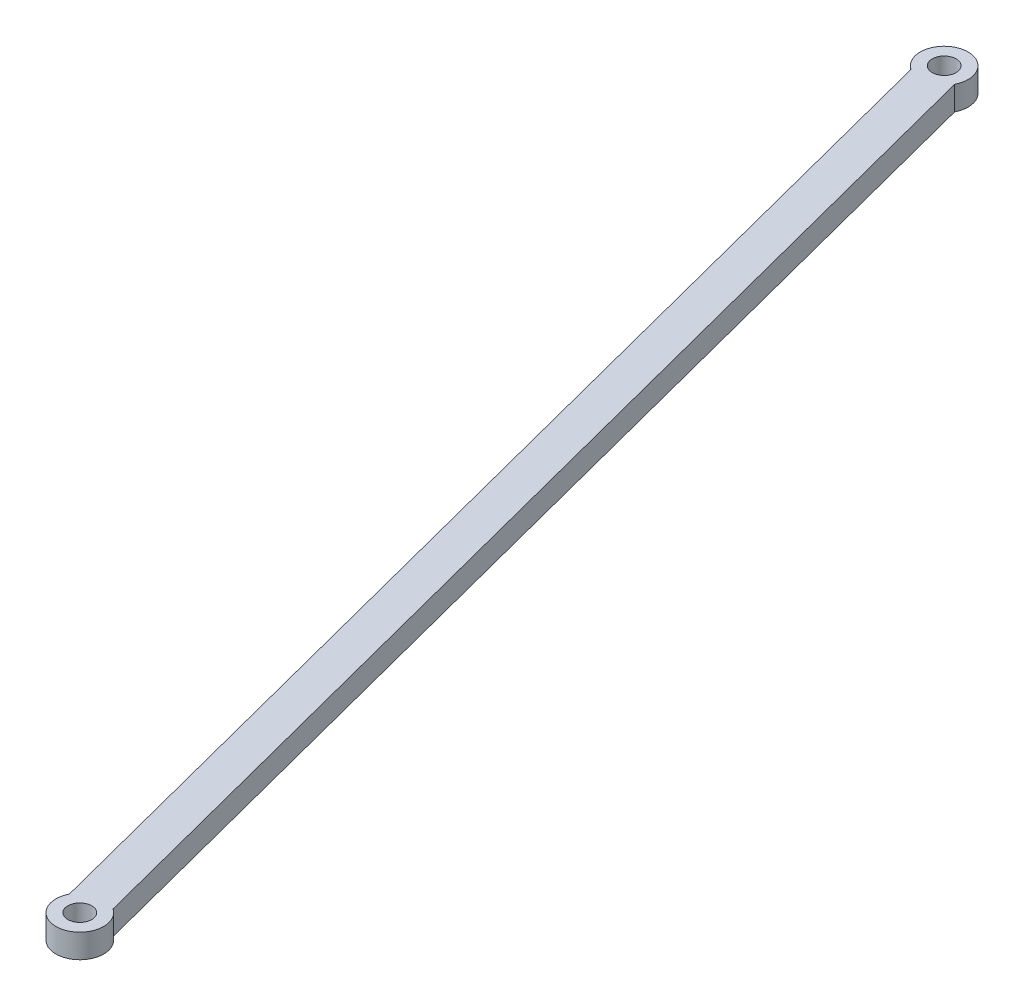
ISO-10303-21;
HEADER;
FILE_DESCRIPTION(('STEP AP214'),'2;1');
FILE_NAME('part.step','',(''),(''),'','','');
FILE_SCHEMA(('AUTOMOTIVE_DESIGN { 1 0 10303 214 1 1 1 1 }'));
ENDSEC;
DATA;
#1=APPLICATION_CONTEXT('core data for automotive mechanical design processes');
#2=APPLICATION_PROTOCOL_DEFINITION('international standard','automotive_design',2000,#1);
#3=PRODUCT_CONTEXT('',#1,'mechanical');
#4=PRODUCT('Part','Part','',(#3));
#5=PRODUCT_RELATED_PRODUCT_CATEGORY('part','',(#4));
#6=PRODUCT_DEFINITION_FORMATION('','',#4);
#7=PRODUCT_DEFINITION_CONTEXT('part definition',#1,'design');
#8=PRODUCT_DEFINITION('design','',#6,#7);
#9=PRODUCT_DEFINITION_SHAPE('','',#8);
#10=(LENGTH_UNIT() NAMED_UNIT(*) SI_UNIT(.MILLI.,.METRE.));
#11=(NAMED_UNIT(*) PLANE_ANGLE_UNIT() SI_UNIT($,.RADIAN.));
#12=(NAMED_UNIT(*) SI_UNIT($,.STERADIAN.) SOLID_ANGLE_UNIT());
#13=UNCERTAINTY_MEASURE_WITH_UNIT(LENGTH_MEASURE(1.E-05),#10,'distance_accuracy_value','');
#14=(GEOMETRIC_REPRESENTATION_CONTEXT(3) GLOBAL_UNCERTAINTY_ASSIGNED_CONTEXT((#13)) GLOBAL_UNIT_ASSIGNED_CONTEXT((#10,
#11,#12)) REPRESENTATION_CONTEXT('',''));
#15=CARTESIAN_POINT('',(0.,0.,0.));
#16=DIRECTION('',(0.,0.,1.));
#17=DIRECTION('',(1.,0.,0.));
#18=AXIS2_PLACEMENT_3D('',#15,#16,#17);
#19=CARTESIAN_POINT('',(-126.,420.,582.5));
#20=DIRECTION('',(0.,1.,0.));
#21=DIRECTION('',(0.,0.,1.));
#22=AXIS2_PLACEMENT_3D('',#19,#20,#21);
#23=PLANE('',#22);
#24=CARTESIAN_POINT('',(-126.,420.,582.5));
#25=DIRECTION('',(0.,1.,0.));
#26=DIRECTION('',(0.,0.,1.));
#27=AXIS2_PLACEMENT_3D('',#24,#25,#26);
#28=CIRCLE('',#27,10.);
#29=CARTESIAN_POINT('',(-126.,420.,592.5));
#30=VERTEX_POINT('',#29);
#31=EDGE_CURVE('E123',#30,#30,#28,.T.);
#32=ORIENTED_EDGE('',*,*,#31,.F.);
#33=EDGE_LOOP('',(#32));
#34=FACE_BOUND('',#33,.T.);
#35=CARTESIAN_POINT('',(-126.,420.,582.5));
#36=DIRECTION('',(0.,1.,0.));
#37=DIRECTION('',(0.,0.,1.));
#38=AXIS2_PLACEMENT_3D('',#35,#36,#37);
#39=CIRCLE('',#38,20.);
#40=CARTESIAN_POINT('',(-108.166893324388,420.,591.55429766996));
#41=VERTEX_POINT('',#40);
#42=CARTESIAN_POINT('',(-137.212420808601,420.,599.061449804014));
#43=VERTEX_POINT('',#42);
#44=EDGE_CURVE('E102',#41,#43,#39,.T.);
#45=ORIENTED_EDGE('',*,*,#44,.T.);
#46=DIRECTION('',(0.25023840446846,0.,0.968184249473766));
#47=VECTOR('',#46,1.);
#48=CARTESIAN_POINT('',(-137.212420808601,420.,599.061449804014));
#49=LINE('',#48,#47);
#50=CARTESIAN_POINT('',(108.156966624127,420.,1548.40724155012));
#51=VERTEX_POINT('',#50);
#52=EDGE_CURVE('E97',#43,#51,#49,.T.);
#53=ORIENTED_EDGE('',*,*,#52,.T.);
#54=CARTESIAN_POINT('',(125.99007329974,420.,1557.46153922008));
#55=DIRECTION('',(0.,1.,0.));
#56=DIRECTION('',(0.,0.,1.));
#57=AXIS2_PLACEMENT_3D('',#54,#55,#56);
#58=CIRCLE('',#57,20.0000000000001);
#59=CARTESIAN_POINT('',(137.202494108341,420.,1540.90008941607));
#60=VERTEX_POINT('',#59);
#61=EDGE_CURVE('E100',#51,#60,#58,.T.);
#62=ORIENTED_EDGE('',*,*,#61,.T.);
#63=DIRECTION('',(-0.250238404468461,0.,-0.968184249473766));
#64=VECTOR('',#63,1.);
#65=CARTESIAN_POINT('',(137.202494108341,420.,1540.90008941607));
#66=LINE('',#65,#64);
#67=EDGE_CURVE('E62',#60,#41,#66,.T.);
#68=ORIENTED_EDGE('',*,*,#67,.T.);
#69=EDGE_LOOP('',(#45,#53,#62,#68));
#70=FACE_BOUND('',#69,.T.);
#71=CARTESIAN_POINT('',(125.99007329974,420.,1557.46153922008));
#72=DIRECTION('',(0.,1.,0.));
#73=DIRECTION('',(0.,0.,1.));
#74=AXIS2_PLACEMENT_3D('',#71,#72,#73);
#75=CIRCLE('',#74,10.);
#76=CARTESIAN_POINT('',(125.99007329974,420.,1567.46153922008));
#77=VERTEX_POINT('',#76);
#78=EDGE_CURVE('E147',#77,#77,#75,.T.);
#79=ORIENTED_EDGE('',*,*,#78,.F.);
#80=EDGE_LOOP('',(#79));
#81=FACE_BOUND('',#80,.T.);
#82=ADVANCED_FACE('F41',(#34,#70,#81),#23,.T.);
#83=CARTESIAN_POINT('',(-126.,400.,582.5));
#84=DIRECTION('',(0.,1.,0.));
#85=DIRECTION('',(0.,0.,1.));
#86=AXIS2_PLACEMENT_3D('',#83,#84,#85);
#87=PLANE('',#86);
#88=CARTESIAN_POINT('',(-126.,400.,582.5));
#89=DIRECTION('',(0.,1.,0.));
#90=DIRECTION('',(0.,0.,1.));
#91=AXIS2_PLACEMENT_3D('',#88,#89,#90);
#92=CIRCLE('',#91,20.);
#93=CARTESIAN_POINT('',(-108.166893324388,400.,591.55429766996));
#94=VERTEX_POINT('',#93);
#95=CARTESIAN_POINT('',(-137.212420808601,400.,599.061449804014));
#96=VERTEX_POINT('',#95);
#97=EDGE_CURVE('E120',#94,#96,#92,.T.);
#98=ORIENTED_EDGE('',*,*,#97,.F.);
#99=DIRECTION('',(-0.250238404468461,0.,-0.968184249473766));
#100=VECTOR('',#99,1.);
#101=CARTESIAN_POINT('',(137.202494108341,400.,1540.90008941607));
#102=LINE('',#101,#100);
#103=CARTESIAN_POINT('',(137.202494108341,400.,1540.90008941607));
#104=VERTEX_POINT('',#103);
#105=EDGE_CURVE('E90',#104,#94,#102,.T.);
#106=ORIENTED_EDGE('',*,*,#105,.F.);
#107=CARTESIAN_POINT('',(125.99007329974,400.,1557.46153922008));
#108=DIRECTION('',(0.,1.,0.));
#109=DIRECTION('',(0.,0.,1.));
#110=AXIS2_PLACEMENT_3D('',#107,#108,#109);
#111=CIRCLE('',#110,20.0000000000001);
#112=CARTESIAN_POINT('',(108.156966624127,400.,1548.40724155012));
#113=VERTEX_POINT('',#112);
#114=EDGE_CURVE('E84',#113,#104,#111,.T.);
#115=ORIENTED_EDGE('',*,*,#114,.F.);
#116=DIRECTION('',(0.25023840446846,0.,0.968184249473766));
#117=VECTOR('',#116,1.);
#118=CARTESIAN_POINT('',(-137.212420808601,400.,599.061449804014));
#119=LINE('',#118,#117);
#120=EDGE_CURVE('E107',#96,#113,#119,.T.);
#121=ORIENTED_EDGE('',*,*,#120,.F.);
#122=EDGE_LOOP('',(#98,#106,#115,#121));
#123=FACE_BOUND('',#122,.T.);
#124=CARTESIAN_POINT('',(-126.,400.,582.5));
#125=DIRECTION('',(0.,1.,0.));
#126=DIRECTION('',(0.,0.,1.));
#127=AXIS2_PLACEMENT_3D('',#124,#125,#126);
#128=CIRCLE('',#127,10.);
#129=CARTESIAN_POINT('',(-126.,400.,592.5));
#130=VERTEX_POINT('',#129);
#131=EDGE_CURVE('E144',#130,#130,#128,.T.);
#132=ORIENTED_EDGE('',*,*,#131,.T.);
#133=EDGE_LOOP('',(#132));
#134=FACE_BOUND('',#133,.T.);
#135=CARTESIAN_POINT('',(125.99007329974,400.,1557.46153922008));
#136=DIRECTION('',(0.,1.,0.));
#137=DIRECTION('',(0.,0.,1.));
#138=AXIS2_PLACEMENT_3D('',#135,#136,#137);
#139=CIRCLE('',#138,10.);
#140=CARTESIAN_POINT('',(125.99007329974,400.,1567.46153922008));
#141=VERTEX_POINT('',#140);
#142=EDGE_CURVE('E150',#141,#141,#139,.T.);
#143=ORIENTED_EDGE('',*,*,#142,.T.);
#144=EDGE_LOOP('',(#143));
#145=FACE_BOUND('',#144,.T.);
#146=ADVANCED_FACE('F137',(#123,#134,#145),#87,.F.);
#147=CARTESIAN_POINT('',(-126.,420.,582.5));
#148=DIRECTION('',(0.,-1.,0.));
#149=DIRECTION('',(0.,0.,-1.));
#150=AXIS2_PLACEMENT_3D('',#147,#148,#149);
#151=CYLINDRICAL_SURFACE('',#150,20.);
#152=ORIENTED_EDGE('',*,*,#97,.T.);
#153=DIRECTION('',(0.,-1.,0.));
#154=VECTOR('',#153,1.);
#155=CARTESIAN_POINT('',(-137.212420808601,420.,599.061449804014));
#156=LINE('',#155,#154);
#157=EDGE_CURVE('E11',#43,#96,#156,.T.);
#158=ORIENTED_EDGE('',*,*,#157,.F.);
#159=ORIENTED_EDGE('',*,*,#44,.F.);
#160=DIRECTION('',(0.,-1.,0.));
#161=VECTOR('',#160,1.);
#162=CARTESIAN_POINT('',(-108.166893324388,420.,591.55429766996));
#163=LINE('',#162,#161);
#164=EDGE_CURVE('E116',#41,#94,#163,.T.);
#165=ORIENTED_EDGE('',*,*,#164,.T.);
#166=EDGE_LOOP('',(#152,#158,#159,#165));
#167=FACE_BOUND('',#166,.T.);
#168=ADVANCED_FACE('F43',(#167),#151,.T.);
#169=CARTESIAN_POINT('',(-137.212420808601,420.,599.061449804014));
#170=DIRECTION('',(0.968184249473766,0.,-0.25023840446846));
#171=DIRECTION('',(-0.25023840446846,0.,-0.968184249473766));
#172=AXIS2_PLACEMENT_3D('',#169,#170,#171);
#173=PLANE('',#172);
#174=ORIENTED_EDGE('',*,*,#120,.T.);
#175=DIRECTION('',(0.,-1.,0.));
#176=VECTOR('',#175,1.);
#177=CARTESIAN_POINT('',(108.156966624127,420.,1548.40724155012));
#178=LINE('',#177,#176);
#179=EDGE_CURVE('E51',#51,#113,#178,.T.);
#180=ORIENTED_EDGE('',*,*,#179,.F.);
#181=ORIENTED_EDGE('',*,*,#52,.F.);
#182=ORIENTED_EDGE('',*,*,#157,.T.);
#183=EDGE_LOOP('',(#174,#180,#181,#182));
#184=FACE_BOUND('',#183,.T.);
#185=ADVANCED_FACE('F106',(#184),#173,.F.);
#186=CARTESIAN_POINT('',(125.99007329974,420.,1557.46153922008));
#187=DIRECTION('',(0.,-1.,0.));
#188=DIRECTION('',(0.,0.,-1.));
#189=AXIS2_PLACEMENT_3D('',#186,#187,#188);
#190=CYLINDRICAL_SURFACE('',#189,20.0000000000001);
#191=ORIENTED_EDGE('',*,*,#114,.T.);
#192=DIRECTION('',(0.,-1.,0.));
#193=VECTOR('',#192,1.);
#194=CARTESIAN_POINT('',(137.202494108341,420.,1540.90008941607));
#195=LINE('',#194,#193);
#196=EDGE_CURVE('E109',#60,#104,#195,.T.);
#197=ORIENTED_EDGE('',*,*,#196,.F.);
#198=ORIENTED_EDGE('',*,*,#61,.F.);
#199=ORIENTED_EDGE('',*,*,#179,.T.);
#200=EDGE_LOOP('',(#191,#197,#198,#199));
#201=FACE_BOUND('',#200,.T.);
#202=ADVANCED_FACE('F110',(#201),#190,.T.);
#203=CARTESIAN_POINT('',(137.202494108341,420.,1540.90008941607));
#204=DIRECTION('',(-0.968184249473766,0.,0.250238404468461));
#205=DIRECTION('',(0.250238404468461,0.,0.968184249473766));
#206=AXIS2_PLACEMENT_3D('',#203,#204,#205);
#207=PLANE('',#206);
#208=ORIENTED_EDGE('',*,*,#105,.T.);
#209=ORIENTED_EDGE('',*,*,#164,.F.);
#210=ORIENTED_EDGE('',*,*,#67,.F.);
#211=ORIENTED_EDGE('',*,*,#196,.T.);
#212=EDGE_LOOP('',(#208,#209,#210,#211));
#213=FACE_BOUND('',#212,.T.);
#214=ADVANCED_FACE('F134',(#213),#207,.F.);
#215=CARTESIAN_POINT('',(-126.,420.,582.5));
#216=DIRECTION('',(0.,-1.,0.));
#217=DIRECTION('',(0.,0.,-1.));
#218=AXIS2_PLACEMENT_3D('',#215,#216,#217);
#219=CYLINDRICAL_SURFACE('',#218,10.);
#220=ORIENTED_EDGE('',*,*,#31,.T.);
#221=EDGE_LOOP('',(#220));
#222=FACE_BOUND('',#221,.T.);
#223=ORIENTED_EDGE('',*,*,#131,.F.);
#224=EDGE_LOOP('',(#223));
#225=FACE_BOUND('',#224,.T.);
#226=ADVANCED_FACE('F167',(#222,#225),#219,.F.);
#227=CARTESIAN_POINT('',(125.99007329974,420.,1557.46153922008));
#228=DIRECTION('',(0.,-1.,0.));
#229=DIRECTION('',(0.,0.,-1.));
#230=AXIS2_PLACEMENT_3D('',#227,#228,#229);
#231=CYLINDRICAL_SURFACE('',#230,10.);
#232=ORIENTED_EDGE('',*,*,#78,.T.);
#233=EDGE_LOOP('',(#232));
#234=FACE_BOUND('',#233,.T.);
#235=ORIENTED_EDGE('',*,*,#142,.F.);
#236=EDGE_LOOP('',(#235));
#237=FACE_BOUND('',#236,.T.);
#238=ADVANCED_FACE('F156',(#234,#237),#231,.F.);
#239=CLOSED_SHELL('',(#82,#146,#168,#185,#202,#214,#226,#238));
#240=MANIFOLD_SOLID_BREP('B2',#239);
#241=ADVANCED_BREP_SHAPE_REPRESENTATION('',(#18,#240),#14);
#242=SHAPE_DEFINITION_REPRESENTATION(#9,#241);
ENDSEC;
END-ISO-10303-21;
